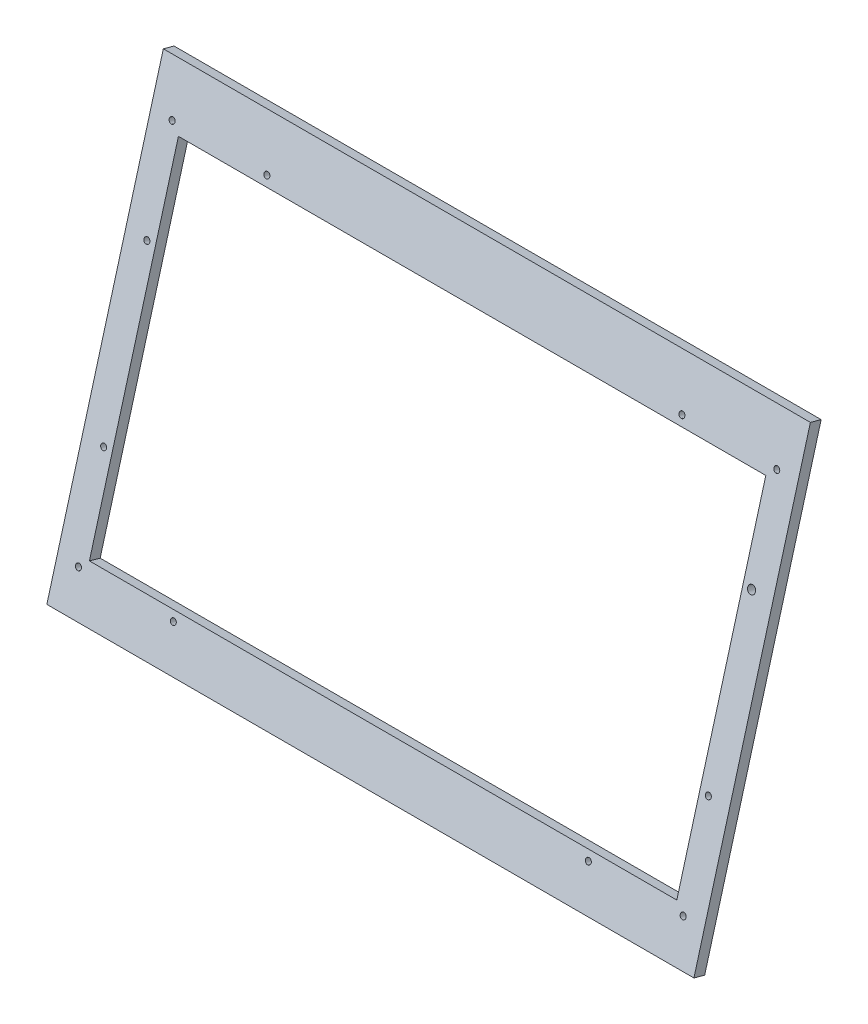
ISO-10303-21;
HEADER;
FILE_DESCRIPTION(('STEP AP214'),'2;1');
FILE_NAME('part.step','',(''),(''),'','','');
FILE_SCHEMA(('AUTOMOTIVE_DESIGN { 1 0 10303 214 1 1 1 1 }'));
ENDSEC;
DATA;
#1=APPLICATION_CONTEXT('core data for automotive mechanical design processes');
#2=APPLICATION_PROTOCOL_DEFINITION('international standard','automotive_design',2000,#1);
#3=PRODUCT_CONTEXT('',#1,'mechanical');
#4=PRODUCT('Part','Part','',(#3));
#5=PRODUCT_RELATED_PRODUCT_CATEGORY('part','',(#4));
#6=PRODUCT_DEFINITION_FORMATION('','',#4);
#7=PRODUCT_DEFINITION_CONTEXT('part definition',#1,'design');
#8=PRODUCT_DEFINITION('design','',#6,#7);
#9=PRODUCT_DEFINITION_SHAPE('','',#8);
#10=(LENGTH_UNIT() NAMED_UNIT(*) SI_UNIT(.MILLI.,.METRE.));
#11=(NAMED_UNIT(*) PLANE_ANGLE_UNIT() SI_UNIT($,.RADIAN.));
#12=(NAMED_UNIT(*) SI_UNIT($,.STERADIAN.) SOLID_ANGLE_UNIT());
#13=UNCERTAINTY_MEASURE_WITH_UNIT(LENGTH_MEASURE(1.E-05),#10,'distance_accuracy_value','');
#14=(GEOMETRIC_REPRESENTATION_CONTEXT(3) GLOBAL_UNCERTAINTY_ASSIGNED_CONTEXT((#13)) GLOBAL_UNIT_ASSIGNED_CONTEXT((#10,
#11,#12)) REPRESENTATION_CONTEXT('',''));
#15=CARTESIAN_POINT('',(0.,0.,0.));
#16=DIRECTION('',(0.,0.,1.));
#17=DIRECTION('',(1.,0.,0.));
#18=AXIS2_PLACEMENT_3D('',#15,#16,#17);
#19=CARTESIAN_POINT('',(600.,-3.42177176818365,-2.4853294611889));
#20=DIRECTION('',(0.,-0.964109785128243,0.265503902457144));
#21=DIRECTION('',(0.,-0.265503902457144,-0.964109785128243));
#22=AXIS2_PLACEMENT_3D('',#19,#20,#21);
#23=PLANE('',#22);
#24=DIRECTION('',(-1.,0.,0.));
#25=VECTOR('',#24,1.);
#26=CARTESIAN_POINT('',(600.,-6.07681079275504,-12.1264273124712));
#27=LINE('',#26,#25);
#28=CARTESIAN_POINT('',(590.,-6.07681079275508,-12.1264273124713));
#29=VERTEX_POINT('',#28);
#30=CARTESIAN_POINT('',(10.,-6.07681079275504,-12.1264273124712));
#31=VERTEX_POINT('',#30);
#32=EDGE_CURVE('E115',#29,#31,#27,.T.);
#33=ORIENTED_EDGE('',*,*,#32,.T.);
#34=DIRECTION('',(0.,0.265503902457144,0.964109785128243));
#35=VECTOR('',#34,1.);
#36=CARTESIAN_POINT('',(10.,-6.07681079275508,-12.1264273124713));
#37=LINE('',#36,#35);
#38=CARTESIAN_POINT('',(10.,-3.42177176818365,-2.4853294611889));
#39=VERTEX_POINT('',#38);
#40=EDGE_CURVE('E55',#31,#39,#37,.T.);
#41=ORIENTED_EDGE('',*,*,#40,.T.);
#42=DIRECTION('',(-1.,0.,0.));
#43=VECTOR('',#42,1.);
#44=CARTESIAN_POINT('',(600.,-3.42177176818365,-2.4853294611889));
#45=LINE('',#44,#43);
#46=CARTESIAN_POINT('',(590.,-3.42177176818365,-2.4853294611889));
#47=VERTEX_POINT('',#46);
#48=EDGE_CURVE('E117',#47,#39,#45,.T.);
#49=ORIENTED_EDGE('',*,*,#48,.F.);
#50=DIRECTION('',(0.,0.265503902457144,0.964109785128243));
#51=VECTOR('',#50,1.);
#52=CARTESIAN_POINT('',(590.,-6.07681079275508,-12.1264273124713));
#53=LINE('',#52,#51);
#54=EDGE_CURVE('E164',#29,#47,#53,.T.);
#55=ORIENTED_EDGE('',*,*,#54,.F.);
#56=EDGE_LOOP('',(#33,#41,#49,#55));
#57=FACE_BOUND('',#56,.T.);
#58=ADVANCED_FACE('F33',(#57),#23,.F.);
#59=CARTESIAN_POINT('',(600.,-382.51938037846,101.913460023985));
#60=DIRECTION('',(0.,-0.265503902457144,-0.964109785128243));
#61=DIRECTION('',(0.,0.964109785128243,-0.265503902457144));
#62=AXIS2_PLACEMENT_3D('',#59,#60,#61);
#63=PLANE('',#62);
#64=CARTESIAN_POINT('',(114.,-348.573074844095,92.5650676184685));
#65=DIRECTION('',(0.,-0.265503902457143,-0.964109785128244));
#66=DIRECTION('',(0.,0.964109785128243,-0.265503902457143));
#67=AXIS2_PLACEMENT_3D('',#64,#65,#66);
#68=CIRCLE('',#67,2.59999999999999);
#69=CARTESIAN_POINT('',(114.,-346.066389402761,91.87475747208));
#70=VERTEX_POINT('',#69);
#71=EDGE_CURVE('E206',#70,#70,#68,.T.);
#72=ORIENTED_EDGE('',*,*,#71,.T.);
#73=EDGE_LOOP('',(#72));
#74=FACE_BOUND('',#73,.T.);
#75=CARTESIAN_POINT('',(486.,-348.573074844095,92.5650676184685));
#76=DIRECTION('',(0.,-0.265503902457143,-0.964109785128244));
#77=DIRECTION('',(0.,0.964109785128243,-0.265503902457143));
#78=AXIS2_PLACEMENT_3D('',#75,#76,#77);
#79=CIRCLE('',#78,2.60000000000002);
#80=CARTESIAN_POINT('',(486.,-346.066389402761,91.87475747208));
#81=VERTEX_POINT('',#80);
#82=EDGE_CURVE('E213',#81,#81,#79,.T.);
#83=ORIENTED_EDGE('',*,*,#82,.T.);
#84=EDGE_LOOP('',(#83));
#85=FACE_BOUND('',#84,.T.);
#86=CARTESIAN_POINT('',(571.,-266.623743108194,69.9972359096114));
#87=DIRECTION('',(0.,-0.265503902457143,-0.964109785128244));
#88=DIRECTION('',(0.,0.964109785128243,-0.265503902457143));
#89=AXIS2_PLACEMENT_3D('',#86,#87,#88);
#90=CIRCLE('',#89,2.59999999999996);
#91=CARTESIAN_POINT('',(571.,-264.117057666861,69.3069257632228));
#92=VERTEX_POINT('',#91);
#93=EDGE_CURVE('E219',#92,#92,#90,.T.);
#94=ORIENTED_EDGE('',*,*,#93,.T.);
#95=EDGE_LOOP('',(#94));
#96=FACE_BOUND('',#95,.T.);
#97=CARTESIAN_POINT('',(486.,-43.9143827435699,8.66583444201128));
#98=DIRECTION('',(0.,-0.265503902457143,-0.964109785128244));
#99=DIRECTION('',(0.,0.964109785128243,-0.265503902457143));
#100=AXIS2_PLACEMENT_3D('',#97,#98,#99);
#101=CIRCLE('',#100,2.60000000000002);
#102=CARTESIAN_POINT('',(486.,-41.4076973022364,7.9755242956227));
#103=VERTEX_POINT('',#102);
#104=EDGE_CURVE('E183',#103,#103,#101,.T.);
#105=ORIENTED_EDGE('',*,*,#104,.T.);
#106=EDGE_LOOP('',(#105));
#107=FACE_BOUND('',#106,.T.);
#108=CARTESIAN_POINT('',(571.,-125.863714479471,31.2336661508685));
#109=DIRECTION('',(0.,-0.265503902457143,-0.964109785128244));
#110=DIRECTION('',(0.,0.964109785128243,-0.265503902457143));
#111=AXIS2_PLACEMENT_3D('',#108,#109,#110);
#112=CIRCLE('',#111,3.52103826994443);
#113=CARTESIAN_POINT('',(571.,-122.469047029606,30.2988167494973));
#114=VERTEX_POINT('',#113);
#115=EDGE_CURVE('E182',#114,#114,#112,.T.);
#116=ORIENTED_EDGE('',*,*,#115,.T.);
#117=EDGE_LOOP('',(#116));
#118=FACE_BOUND('',#117,.T.);
#119=CARTESIAN_POINT('',(29.0000000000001,-43.9143827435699,8.66583444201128));
#120=DIRECTION('',(0.,-0.265503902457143,-0.964109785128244));
#121=DIRECTION('',(0.,0.964109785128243,-0.265503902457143));
#122=AXIS2_PLACEMENT_3D('',#119,#120,#121);
#123=CIRCLE('',#122,2.6);
#124=CARTESIAN_POINT('',(29.0000000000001,-41.4076973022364,7.97552429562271));
#125=VERTEX_POINT('',#124);
#126=EDGE_CURVE('E189',#125,#125,#123,.T.);
#127=ORIENTED_EDGE('',*,*,#126,.T.);
#128=EDGE_LOOP('',(#127));
#129=FACE_BOUND('',#128,.T.);
#130=CARTESIAN_POINT('',(29.0000000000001,-348.573074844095,92.5650676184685));
#131=DIRECTION('',(0.,-0.265503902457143,-0.964109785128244));
#132=DIRECTION('',(0.,0.964109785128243,-0.265503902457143));
#133=AXIS2_PLACEMENT_3D('',#130,#131,#132);
#134=CIRCLE('',#133,2.6);
#135=CARTESIAN_POINT('',(29.0000000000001,-346.066389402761,91.87475747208));
#136=VERTEX_POINT('',#135);
#137=EDGE_CURVE('E195',#136,#136,#134,.T.);
#138=ORIENTED_EDGE('',*,*,#137,.T.);
#139=EDGE_LOOP('',(#138));
#140=FACE_BOUND('',#139,.T.);
#141=CARTESIAN_POINT('',(571.,-348.573074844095,92.5650676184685));
#142=DIRECTION('',(0.,-0.265503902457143,-0.964109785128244));
#143=DIRECTION('',(0.,0.964109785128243,-0.265503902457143));
#144=AXIS2_PLACEMENT_3D('',#141,#142,#143);
#145=CIRCLE('',#144,2.59999999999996);
#146=CARTESIAN_POINT('',(571.,-346.066389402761,91.87475747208));
#147=VERTEX_POINT('',#146);
#148=EDGE_CURVE('E176',#147,#147,#145,.T.);
#149=ORIENTED_EDGE('',*,*,#148,.T.);
#150=EDGE_LOOP('',(#149));
#151=FACE_BOUND('',#150,.T.);
#152=CARTESIAN_POINT('',(29.0000000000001,-266.623743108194,69.9972359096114));
#153=DIRECTION('',(0.,-0.265503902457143,-0.964109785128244));
#154=DIRECTION('',(0.,0.964109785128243,-0.265503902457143));
#155=AXIS2_PLACEMENT_3D('',#152,#153,#154);
#156=CIRCLE('',#155,2.6);
#157=CARTESIAN_POINT('',(29.0000000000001,-264.117057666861,69.3069257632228));
#158=VERTEX_POINT('',#157);
#159=EDGE_CURVE('E207',#158,#158,#156,.T.);
#160=ORIENTED_EDGE('',*,*,#159,.T.);
#161=EDGE_LOOP('',(#160));
#162=FACE_BOUND('',#161,.T.);
#163=CARTESIAN_POINT('',(29.0000000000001,-125.863714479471,31.2336661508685));
#164=DIRECTION('',(0.,-0.265503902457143,-0.964109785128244));
#165=DIRECTION('',(0.,0.964109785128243,-0.265503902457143));
#166=AXIS2_PLACEMENT_3D('',#163,#164,#165);
#167=CIRCLE('',#166,2.59999999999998);
#168=CARTESIAN_POINT('',(29.0000000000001,-123.357029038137,30.5433560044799));
#169=VERTEX_POINT('',#168);
#170=EDGE_CURVE('E236',#169,#169,#167,.T.);
#171=ORIENTED_EDGE('',*,*,#170,.T.);
#172=EDGE_LOOP('',(#171));
#173=FACE_BOUND('',#172,.T.);
#174=CARTESIAN_POINT('',(114.,-43.9143827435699,8.66583444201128));
#175=DIRECTION('',(0.,-0.265503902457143,-0.964109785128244));
#176=DIRECTION('',(0.,0.964109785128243,-0.265503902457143));
#177=AXIS2_PLACEMENT_3D('',#174,#175,#176);
#178=CIRCLE('',#177,2.59999999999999);
#179=CARTESIAN_POINT('',(114.,-41.4076973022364,7.97552429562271));
#180=VERTEX_POINT('',#179);
#181=EDGE_CURVE('E230',#180,#180,#178,.T.);
#182=ORIENTED_EDGE('',*,*,#181,.T.);
#183=EDGE_LOOP('',(#182));
#184=FACE_BOUND('',#183,.T.);
#185=CARTESIAN_POINT('',(571.,-43.9143827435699,8.66583444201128));
#186=DIRECTION('',(0.,-0.265503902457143,-0.964109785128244));
#187=DIRECTION('',(0.,0.964109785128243,-0.265503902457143));
#188=AXIS2_PLACEMENT_3D('',#185,#186,#187);
#189=CIRCLE('',#188,2.59999999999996);
#190=CARTESIAN_POINT('',(571.,-41.4076973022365,7.97552429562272));
#191=VERTEX_POINT('',#190);
#192=EDGE_CURVE('E169',#191,#191,#189,.T.);
#193=ORIENTED_EDGE('',*,*,#192,.T.);
#194=EDGE_LOOP('',(#193));
#195=FACE_BOUND('',#194,.T.);
#196=DIRECTION('',(1.,0.,0.));
#197=VECTOR('',#196,1.);
#198=CARTESIAN_POINT('',(36.7500000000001,-341.101224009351,90.5074123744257));
#199=LINE('',#198,#197);
#200=CARTESIAN_POINT('',(36.7500000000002,-341.101224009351,90.5074123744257));
#201=VERTEX_POINT('',#200);
#202=CARTESIAN_POINT('',(563.25,-341.101224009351,90.5074123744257));
#203=VERTEX_POINT('',#202);
#204=EDGE_CURVE('E158',#201,#203,#199,.T.);
#205=ORIENTED_EDGE('',*,*,#204,.F.);
#206=DIRECTION('',(0.,-0.964109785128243,0.265503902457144));
#207=VECTOR('',#206,1.);
#208=CARTESIAN_POINT('',(36.7500000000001,-51.3862335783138,10.723489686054));
#209=LINE('',#208,#207);
#210=CARTESIAN_POINT('',(36.7500000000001,-51.3862335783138,10.723489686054));
#211=VERTEX_POINT('',#210);
#212=EDGE_CURVE('E162',#211,#201,#209,.T.);
#213=ORIENTED_EDGE('',*,*,#212,.F.);
#214=DIRECTION('',(-1.,0.,0.));
#215=VECTOR('',#214,1.);
#216=CARTESIAN_POINT('',(36.7500000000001,-51.3862335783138,10.723489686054));
#217=LINE('',#216,#215);
#218=CARTESIAN_POINT('',(563.25,-51.3862335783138,10.723489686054));
#219=VERTEX_POINT('',#218);
#220=EDGE_CURVE('E152',#219,#211,#217,.T.);
#221=ORIENTED_EDGE('',*,*,#220,.F.);
#222=DIRECTION('',(0.,0.964109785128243,-0.265503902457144));
#223=VECTOR('',#222,1.);
#224=CARTESIAN_POINT('',(563.25,-51.3862335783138,10.723489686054));
#225=LINE('',#224,#223);
#226=EDGE_CURVE('E143',#203,#219,#225,.T.);
#227=ORIENTED_EDGE('',*,*,#226,.F.);
#228=EDGE_LOOP('',(#205,#213,#221,#227));
#229=FACE_BOUND('',#228,.T.);
#230=ORIENTED_EDGE('',*,*,#48,.T.);
#231=DIRECTION('',(0.,0.964109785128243,-0.265503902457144));
#232=VECTOR('',#231,1.);
#233=CARTESIAN_POINT('',(10.,-3.42177176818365,-2.4853294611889));
#234=LINE('',#233,#232);
#235=CARTESIAN_POINT('',(10.,-382.51938037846,101.913460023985));
#236=VERTEX_POINT('',#235);
#237=EDGE_CURVE('E103',#236,#39,#234,.T.);
#238=ORIENTED_EDGE('',*,*,#237,.F.);
#239=DIRECTION('',(-1.,0.,0.));
#240=VECTOR('',#239,1.);
#241=CARTESIAN_POINT('',(600.,-382.51938037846,101.913460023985));
#242=LINE('',#241,#240);
#243=CARTESIAN_POINT('',(590.,-382.51938037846,101.913460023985));
#244=VERTEX_POINT('',#243);
#245=EDGE_CURVE('E111',#244,#236,#242,.T.);
#246=ORIENTED_EDGE('',*,*,#245,.F.);
#247=DIRECTION('',(0.,-0.964109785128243,0.265503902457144));
#248=VECTOR('',#247,1.);
#249=CARTESIAN_POINT('',(590.,-3.42177176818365,-2.4853294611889));
#250=LINE('',#249,#248);
#251=EDGE_CURVE('E167',#47,#244,#250,.T.);
#252=ORIENTED_EDGE('',*,*,#251,.F.);
#253=EDGE_LOOP('',(#230,#238,#246,#252));
#254=FACE_BOUND('',#253,.T.);
#255=ADVANCED_FACE('F245',(#74,#85,#96,#107,#118,#129,#140,#151,#162,#173,#184,#195,#229,#254),
#63,.F.);
#256=CARTESIAN_POINT('',(600.,-385.174419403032,92.2723621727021));
#257=DIRECTION('',(0.,0.964109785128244,-0.265503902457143));
#258=DIRECTION('',(0.,0.265503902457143,0.964109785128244));
#259=AXIS2_PLACEMENT_3D('',#256,#257,#258);
#260=PLANE('',#259);
#261=ORIENTED_EDGE('',*,*,#245,.T.);
#262=DIRECTION('',(0.,0.265503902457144,0.964109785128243));
#263=VECTOR('',#262,1.);
#264=CARTESIAN_POINT('',(10.,-385.174419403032,92.2723621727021));
#265=LINE('',#264,#263);
#266=CARTESIAN_POINT('',(10.,-385.174419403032,92.2723621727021));
#267=VERTEX_POINT('',#266);
#268=EDGE_CURVE('E97',#267,#236,#265,.T.);
#269=ORIENTED_EDGE('',*,*,#268,.F.);
#270=DIRECTION('',(-1.,0.,0.));
#271=VECTOR('',#270,1.);
#272=CARTESIAN_POINT('',(600.,-385.174419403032,92.2723621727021));
#273=LINE('',#272,#271);
#274=CARTESIAN_POINT('',(590.,-385.174419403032,92.2723621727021));
#275=VERTEX_POINT('',#274);
#276=EDGE_CURVE('E109',#275,#267,#273,.T.);
#277=ORIENTED_EDGE('',*,*,#276,.F.);
#278=DIRECTION('',(0.,0.265503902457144,0.964109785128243));
#279=VECTOR('',#278,1.);
#280=CARTESIAN_POINT('',(590.,-385.174419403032,92.2723621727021));
#281=LINE('',#280,#279);
#282=EDGE_CURVE('E47',#275,#244,#281,.T.);
#283=ORIENTED_EDGE('',*,*,#282,.T.);
#284=EDGE_LOOP('',(#261,#269,#277,#283));
#285=FACE_BOUND('',#284,.T.);
#286=ADVANCED_FACE('F108',(#285),#260,.F.);
#287=CARTESIAN_POINT('',(600.,-6.07681079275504,-12.1264273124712));
#288=DIRECTION('',(0.,0.265503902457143,0.964109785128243));
#289=DIRECTION('',(0.,-0.964109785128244,0.265503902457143));
#290=AXIS2_PLACEMENT_3D('',#287,#288,#289);
#291=PLANE('',#290);
#292=CARTESIAN_POINT('',(114.,-351.228113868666,82.9239697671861));
#293=DIRECTION('',(0.,-0.265503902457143,-0.964109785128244));
#294=DIRECTION('',(0.,0.964109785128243,-0.265503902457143));
#295=AXIS2_PLACEMENT_3D('',#292,#293,#294);
#296=CIRCLE('',#295,2.59999999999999);
#297=CARTESIAN_POINT('',(114.,-348.721428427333,82.2336596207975));
#298=VERTEX_POINT('',#297);
#299=EDGE_CURVE('E203',#298,#298,#296,.T.);
#300=ORIENTED_EDGE('',*,*,#299,.F.);
#301=EDGE_LOOP('',(#300));
#302=FACE_BOUND('',#301,.T.);
#303=CARTESIAN_POINT('',(486.,-351.228113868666,82.9239697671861));
#304=DIRECTION('',(0.,-0.265503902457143,-0.964109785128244));
#305=DIRECTION('',(0.,0.964109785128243,-0.265503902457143));
#306=AXIS2_PLACEMENT_3D('',#303,#304,#305);
#307=CIRCLE('',#306,2.60000000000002);
#308=CARTESIAN_POINT('',(486.,-348.721428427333,82.2336596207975));
#309=VERTEX_POINT('',#308);
#310=EDGE_CURVE('E210',#309,#309,#307,.T.);
#311=ORIENTED_EDGE('',*,*,#310,.F.);
#312=EDGE_LOOP('',(#311));
#313=FACE_BOUND('',#312,.T.);
#314=CARTESIAN_POINT('',(571.,-269.278782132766,60.3561380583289));
#315=DIRECTION('',(0.,-0.265503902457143,-0.964109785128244));
#316=DIRECTION('',(0.,0.964109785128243,-0.265503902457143));
#317=AXIS2_PLACEMENT_3D('',#314,#315,#316);
#318=CIRCLE('',#317,2.59999999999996);
#319=CARTESIAN_POINT('',(571.,-266.772096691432,59.6658279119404));
#320=VERTEX_POINT('',#319);
#321=EDGE_CURVE('E216',#320,#320,#318,.T.);
#322=ORIENTED_EDGE('',*,*,#321,.F.);
#323=EDGE_LOOP('',(#322));
#324=FACE_BOUND('',#323,.T.);
#325=CARTESIAN_POINT('',(486.,-46.5694217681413,-0.975263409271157));
#326=DIRECTION('',(0.,-0.265503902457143,-0.964109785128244));
#327=DIRECTION('',(0.,0.964109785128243,-0.265503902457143));
#328=AXIS2_PLACEMENT_3D('',#325,#326,#327);
#329=CIRCLE('',#328,2.60000000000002);
#330=CARTESIAN_POINT('',(486.,-44.0627363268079,-1.66557355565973));
#331=VERTEX_POINT('',#330);
#332=EDGE_CURVE('E222',#331,#331,#329,.T.);
#333=ORIENTED_EDGE('',*,*,#332,.F.);
#334=EDGE_LOOP('',(#333));
#335=FACE_BOUND('',#334,.T.);
#336=CARTESIAN_POINT('',(571.,-128.518753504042,21.592568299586));
#337=DIRECTION('',(0.,-0.265503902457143,-0.964109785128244));
#338=DIRECTION('',(0.,0.964109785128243,-0.265503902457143));
#339=AXIS2_PLACEMENT_3D('',#336,#337,#338);
#340=CIRCLE('',#339,3.52103826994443);
#341=CARTESIAN_POINT('',(571.,-125.124086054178,20.6577188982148));
#342=VERTEX_POINT('',#341);
#343=EDGE_CURVE('E179',#342,#342,#340,.T.);
#344=ORIENTED_EDGE('',*,*,#343,.F.);
#345=EDGE_LOOP('',(#344));
#346=FACE_BOUND('',#345,.T.);
#347=CARTESIAN_POINT('',(29.0000000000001,-46.5694217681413,-0.975263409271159));
#348=DIRECTION('',(0.,-0.265503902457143,-0.964109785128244));
#349=DIRECTION('',(0.,0.964109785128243,-0.265503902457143));
#350=AXIS2_PLACEMENT_3D('',#347,#348,#349);
#351=CIRCLE('',#350,2.6);
#352=CARTESIAN_POINT('',(29.0000000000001,-44.0627363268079,-1.66557355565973));
#353=VERTEX_POINT('',#352);
#354=EDGE_CURVE('E186',#353,#353,#351,.T.);
#355=ORIENTED_EDGE('',*,*,#354,.F.);
#356=EDGE_LOOP('',(#355));
#357=FACE_BOUND('',#356,.T.);
#358=CARTESIAN_POINT('',(29.0000000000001,-351.228113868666,82.9239697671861));
#359=DIRECTION('',(0.,-0.265503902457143,-0.964109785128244));
#360=DIRECTION('',(0.,0.964109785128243,-0.265503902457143));
#361=AXIS2_PLACEMENT_3D('',#358,#359,#360);
#362=CIRCLE('',#361,2.6);
#363=CARTESIAN_POINT('',(29.0000000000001,-348.721428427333,82.2336596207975));
#364=VERTEX_POINT('',#363);
#365=EDGE_CURVE('E192',#364,#364,#362,.T.);
#366=ORIENTED_EDGE('',*,*,#365,.F.);
#367=EDGE_LOOP('',(#366));
#368=FACE_BOUND('',#367,.T.);
#369=CARTESIAN_POINT('',(571.,-351.228113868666,82.9239697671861));
#370=DIRECTION('',(0.,-0.265503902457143,-0.964109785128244));
#371=DIRECTION('',(0.,0.964109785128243,-0.265503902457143));
#372=AXIS2_PLACEMENT_3D('',#369,#370,#371);
#373=CIRCLE('',#372,2.59999999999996);
#374=CARTESIAN_POINT('',(571.,-348.721428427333,82.2336596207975));
#375=VERTEX_POINT('',#374);
#376=EDGE_CURVE('E198',#375,#375,#373,.T.);
#377=ORIENTED_EDGE('',*,*,#376,.F.);
#378=EDGE_LOOP('',(#377));
#379=FACE_BOUND('',#378,.T.);
#380=CARTESIAN_POINT('',(29.0000000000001,-269.278782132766,60.3561380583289));
#381=DIRECTION('',(0.,-0.265503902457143,-0.964109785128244));
#382=DIRECTION('',(0.,0.964109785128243,-0.265503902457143));
#383=AXIS2_PLACEMENT_3D('',#380,#381,#382);
#384=CIRCLE('',#383,2.6);
#385=CARTESIAN_POINT('',(29.0000000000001,-266.772096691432,59.6658279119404));
#386=VERTEX_POINT('',#385);
#387=EDGE_CURVE('E239',#386,#386,#384,.T.);
#388=ORIENTED_EDGE('',*,*,#387,.F.);
#389=EDGE_LOOP('',(#388));
#390=FACE_BOUND('',#389,.T.);
#391=CARTESIAN_POINT('',(29.0000000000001,-128.518753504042,21.592568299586));
#392=DIRECTION('',(0.,-0.265503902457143,-0.964109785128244));
#393=DIRECTION('',(0.,0.964109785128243,-0.265503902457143));
#394=AXIS2_PLACEMENT_3D('',#391,#392,#393);
#395=CIRCLE('',#394,2.59999999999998);
#396=CARTESIAN_POINT('',(29.0000000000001,-126.012068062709,20.9022581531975));
#397=VERTEX_POINT('',#396);
#398=EDGE_CURVE('E233',#397,#397,#395,.T.);
#399=ORIENTED_EDGE('',*,*,#398,.F.);
#400=EDGE_LOOP('',(#399));
#401=FACE_BOUND('',#400,.T.);
#402=CARTESIAN_POINT('',(114.,-46.5694217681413,-0.975263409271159));
#403=DIRECTION('',(0.,-0.265503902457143,-0.964109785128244));
#404=DIRECTION('',(0.,0.964109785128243,-0.265503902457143));
#405=AXIS2_PLACEMENT_3D('',#402,#403,#404);
#406=CIRCLE('',#405,2.59999999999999);
#407=CARTESIAN_POINT('',(114.,-44.0627363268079,-1.66557355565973));
#408=VERTEX_POINT('',#407);
#409=EDGE_CURVE('E227',#408,#408,#406,.T.);
#410=ORIENTED_EDGE('',*,*,#409,.F.);
#411=EDGE_LOOP('',(#410));
#412=FACE_BOUND('',#411,.T.);
#413=CARTESIAN_POINT('',(571.,-46.5694217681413,-0.975263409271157));
#414=DIRECTION('',(0.,-0.265503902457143,-0.964109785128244));
#415=DIRECTION('',(0.,0.964109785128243,-0.265503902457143));
#416=AXIS2_PLACEMENT_3D('',#413,#414,#415);
#417=CIRCLE('',#416,2.59999999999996);
#418=CARTESIAN_POINT('',(571.,-44.0627363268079,-1.66557355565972));
#419=VERTEX_POINT('',#418);
#420=EDGE_CURVE('E173',#419,#419,#417,.T.);
#421=ORIENTED_EDGE('',*,*,#420,.F.);
#422=EDGE_LOOP('',(#421));
#423=FACE_BOUND('',#422,.T.);
#424=DIRECTION('',(-1.,0.,0.));
#425=VECTOR('',#424,1.);
#426=CARTESIAN_POINT('',(600.,-54.0412726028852,1.0823918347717));
#427=LINE('',#426,#425);
#428=CARTESIAN_POINT('',(563.25,-54.0412726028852,1.08239183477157));
#429=VERTEX_POINT('',#428);
#430=CARTESIAN_POINT('',(36.7500000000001,-54.0412726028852,1.08239183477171));
#431=VERTEX_POINT('',#430);
#432=EDGE_CURVE('E40',#429,#431,#427,.T.);
#433=ORIENTED_EDGE('',*,*,#432,.T.);
#434=DIRECTION('',(0.,-0.964109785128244,0.265503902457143));
#435=VECTOR('',#434,1.);
#436=CARTESIAN_POINT('',(36.7500000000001,-6.07681079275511,-12.1264273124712));
#437=LINE('',#436,#435);
#438=CARTESIAN_POINT('',(36.7500000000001,-343.756263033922,80.8663145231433));
#439=VERTEX_POINT('',#438);
#440=EDGE_CURVE('E11',#431,#439,#437,.T.);
#441=ORIENTED_EDGE('',*,*,#440,.T.);
#442=DIRECTION('',(1.,0.,0.));
#443=VECTOR('',#442,1.);
#444=CARTESIAN_POINT('',(600.,-343.756263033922,80.8663145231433));
#445=LINE('',#444,#443);
#446=CARTESIAN_POINT('',(563.25,-343.756263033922,80.8663145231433));
#447=VERTEX_POINT('',#446);
#448=EDGE_CURVE('E125',#439,#447,#445,.T.);
#449=ORIENTED_EDGE('',*,*,#448,.T.);
#450=DIRECTION('',(0.,0.964109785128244,-0.265503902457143));
#451=VECTOR('',#450,1.);
#452=CARTESIAN_POINT('',(563.25,-6.07681079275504,-12.1264273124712));
#453=LINE('',#452,#451);
#454=EDGE_CURVE('E128',#447,#429,#453,.T.);
#455=ORIENTED_EDGE('',*,*,#454,.T.);
#456=EDGE_LOOP('',(#433,#441,#449,#455));
#457=FACE_BOUND('',#456,.T.);
#458=ORIENTED_EDGE('',*,*,#276,.T.);
#459=DIRECTION('',(0.,0.964109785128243,-0.265503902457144));
#460=VECTOR('',#459,1.);
#461=CARTESIAN_POINT('',(10.,-6.07681079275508,-12.1264273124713));
#462=LINE('',#461,#460);
#463=EDGE_CURVE('E94',#267,#31,#462,.T.);
#464=ORIENTED_EDGE('',*,*,#463,.T.);
#465=ORIENTED_EDGE('',*,*,#32,.F.);
#466=DIRECTION('',(0.,-0.964109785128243,0.265503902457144));
#467=VECTOR('',#466,1.);
#468=CARTESIAN_POINT('',(590.,-6.07681079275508,-12.1264273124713));
#469=LINE('',#468,#467);
#470=EDGE_CURVE('E114',#29,#275,#469,.T.);
#471=ORIENTED_EDGE('',*,*,#470,.T.);
#472=EDGE_LOOP('',(#458,#464,#465,#471));
#473=FACE_BOUND('',#472,.T.);
#474=ADVANCED_FACE('F113',(#302,#313,#324,#335,#346,#357,#368,#379,#390,#401,#412,#423,#457,
#473),#291,.F.);
#475=CARTESIAN_POINT('',(36.7500000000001,-184.138184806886,-471.331402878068));
#476=DIRECTION('',(-1.,0.,0.));
#477=DIRECTION('',(0.,-1.,0.));
#478=AXIS2_PLACEMENT_3D('',#475,#476,#477);
#479=PLANE('',#478);
#480=DIRECTION('',(0.,0.265503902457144,0.964109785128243));
#481=VECTOR('',#480,1.);
#482=CARTESIAN_POINT('',(36.7500000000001,-184.138184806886,-471.331402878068));
#483=LINE('',#482,#481);
#484=EDGE_CURVE('E119',#431,#211,#483,.T.);
#485=ORIENTED_EDGE('',*,*,#484,.T.);
#486=ORIENTED_EDGE('',*,*,#212,.T.);
#487=DIRECTION('',(0.,0.265503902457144,0.964109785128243));
#488=VECTOR('',#487,1.);
#489=CARTESIAN_POINT('',(36.7500000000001,-473.853175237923,-391.547480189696));
#490=LINE('',#489,#488);
#491=EDGE_CURVE('E148',#439,#201,#490,.T.);
#492=ORIENTED_EDGE('',*,*,#491,.F.);
#493=ORIENTED_EDGE('',*,*,#440,.F.);
#494=EDGE_LOOP('',(#485,#486,#492,#493));
#495=FACE_BOUND('',#494,.T.);
#496=ADVANCED_FACE('F258',(#495),#479,.F.);
#497=CARTESIAN_POINT('',(36.7500000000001,-184.138184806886,-471.331402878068));
#498=DIRECTION('',(0.,0.964109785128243,-0.265503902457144));
#499=DIRECTION('',(0.,0.265503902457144,0.964109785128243));
#500=AXIS2_PLACEMENT_3D('',#497,#498,#499);
#501=PLANE('',#500);
#502=DIRECTION('',(0.,0.265503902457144,0.964109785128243));
#503=VECTOR('',#502,1.);
#504=CARTESIAN_POINT('',(563.25,-184.138184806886,-471.331402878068));
#505=LINE('',#504,#503);
#506=EDGE_CURVE('E138',#429,#219,#505,.T.);
#507=ORIENTED_EDGE('',*,*,#506,.T.);
#508=ORIENTED_EDGE('',*,*,#220,.T.);
#509=ORIENTED_EDGE('',*,*,#484,.F.);
#510=ORIENTED_EDGE('',*,*,#432,.F.);
#511=EDGE_LOOP('',(#507,#508,#509,#510));
#512=FACE_BOUND('',#511,.T.);
#513=ADVANCED_FACE('F136',(#512),#501,.F.);
#514=CARTESIAN_POINT('',(563.25,-184.138184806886,-471.331402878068));
#515=DIRECTION('',(1.,0.,0.));
#516=DIRECTION('',(0.,0.,-1.));
#517=AXIS2_PLACEMENT_3D('',#514,#515,#516);
#518=PLANE('',#517);
#519=DIRECTION('',(0.,0.265503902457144,0.964109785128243));
#520=VECTOR('',#519,1.);
#521=CARTESIAN_POINT('',(563.25,-473.853175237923,-391.547480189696));
#522=LINE('',#521,#520);
#523=EDGE_CURVE('E145',#447,#203,#522,.T.);
#524=ORIENTED_EDGE('',*,*,#523,.T.);
#525=ORIENTED_EDGE('',*,*,#226,.T.);
#526=ORIENTED_EDGE('',*,*,#506,.F.);
#527=ORIENTED_EDGE('',*,*,#454,.F.);
#528=EDGE_LOOP('',(#524,#525,#526,#527));
#529=FACE_BOUND('',#528,.T.);
#530=ADVANCED_FACE('F141',(#529),#518,.F.);
#531=CARTESIAN_POINT('',(36.7500000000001,-473.853175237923,-391.547480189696));
#532=DIRECTION('',(0.,-0.964109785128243,0.265503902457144));
#533=DIRECTION('',(0.,-0.265503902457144,-0.964109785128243));
#534=AXIS2_PLACEMENT_3D('',#531,#532,#533);
#535=PLANE('',#534);
#536=ORIENTED_EDGE('',*,*,#491,.T.);
#537=ORIENTED_EDGE('',*,*,#204,.T.);
#538=ORIENTED_EDGE('',*,*,#523,.F.);
#539=ORIENTED_EDGE('',*,*,#448,.F.);
#540=EDGE_LOOP('',(#536,#537,#538,#539));
#541=FACE_BOUND('',#540,.T.);
#542=ADVANCED_FACE('F294',(#541),#535,.F.);
#543=CARTESIAN_POINT('',(590.,-6.07681079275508,-12.1264273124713));
#544=DIRECTION('',(-1.,0.,0.));
#545=DIRECTION('',(0.,0.,1.));
#546=AXIS2_PLACEMENT_3D('',#543,#544,#545);
#547=PLANE('',#546);
#548=ORIENTED_EDGE('',*,*,#251,.T.);
#549=ORIENTED_EDGE('',*,*,#282,.F.);
#550=ORIENTED_EDGE('',*,*,#470,.F.);
#551=ORIENTED_EDGE('',*,*,#54,.T.);
#552=EDGE_LOOP('',(#548,#549,#550,#551));
#553=FACE_BOUND('',#552,.T.);
#554=ADVANCED_FACE('F278',(#553),#547,.F.);
#555=CARTESIAN_POINT('',(10.,-6.07681079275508,-12.1264273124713));
#556=DIRECTION('',(1.,0.,0.));
#557=DIRECTION('',(0.,1.,0.));
#558=AXIS2_PLACEMENT_3D('',#555,#556,#557);
#559=PLANE('',#558);
#560=ORIENTED_EDGE('',*,*,#237,.T.);
#561=ORIENTED_EDGE('',*,*,#40,.F.);
#562=ORIENTED_EDGE('',*,*,#463,.F.);
#563=ORIENTED_EDGE('',*,*,#268,.T.);
#564=EDGE_LOOP('',(#560,#561,#562,#563));
#565=FACE_BOUND('',#564,.T.);
#566=ADVANCED_FACE('F96',(#565),#559,.F.);
#567=CARTESIAN_POINT('',(571.,-43.9143827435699,8.66583444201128));
#568=DIRECTION('',(0.,-0.265503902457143,-0.964109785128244));
#569=DIRECTION('',(0.,0.964109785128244,-0.265503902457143));
#570=AXIS2_PLACEMENT_3D('',#567,#568,#569);
#571=CYLINDRICAL_SURFACE('',#570,2.59999999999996);
#572=ORIENTED_EDGE('',*,*,#192,.F.);
#573=EDGE_LOOP('',(#572));
#574=FACE_BOUND('',#573,.T.);
#575=ORIENTED_EDGE('',*,*,#420,.T.);
#576=EDGE_LOOP('',(#575));
#577=FACE_BOUND('',#576,.T.);
#578=ADVANCED_FACE('F267',(#574,#577),#571,.F.);
#579=CARTESIAN_POINT('',(114.,-43.9143827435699,8.66583444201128));
#580=DIRECTION('',(0.,-0.265503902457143,-0.964109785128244));
#581=DIRECTION('',(0.,0.964109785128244,-0.265503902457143));
#582=AXIS2_PLACEMENT_3D('',#579,#580,#581);
#583=CYLINDRICAL_SURFACE('',#582,2.59999999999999);
#584=ORIENTED_EDGE('',*,*,#181,.F.);
#585=EDGE_LOOP('',(#584));
#586=FACE_BOUND('',#585,.T.);
#587=ORIENTED_EDGE('',*,*,#409,.T.);
#588=EDGE_LOOP('',(#587));
#589=FACE_BOUND('',#588,.T.);
#590=ADVANCED_FACE('F269',(#586,#589),#583,.F.);
#591=CARTESIAN_POINT('',(29.0000000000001,-125.863714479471,31.2336661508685));
#592=DIRECTION('',(0.,-0.265503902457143,-0.964109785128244));
#593=DIRECTION('',(0.,0.964109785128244,-0.265503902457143));
#594=AXIS2_PLACEMENT_3D('',#591,#592,#593);
#595=CYLINDRICAL_SURFACE('',#594,2.59999999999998);
#596=ORIENTED_EDGE('',*,*,#170,.F.);
#597=EDGE_LOOP('',(#596));
#598=FACE_BOUND('',#597,.T.);
#599=ORIENTED_EDGE('',*,*,#398,.T.);
#600=EDGE_LOOP('',(#599));
#601=FACE_BOUND('',#600,.T.);
#602=ADVANCED_FACE('F252',(#598,#601),#595,.F.);
#603=CARTESIAN_POINT('',(29.0000000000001,-266.623743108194,69.9972359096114));
#604=DIRECTION('',(0.,-0.265503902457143,-0.964109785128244));
#605=DIRECTION('',(0.,0.964109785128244,-0.265503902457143));
#606=AXIS2_PLACEMENT_3D('',#603,#604,#605);
#607=CYLINDRICAL_SURFACE('',#606,2.6);
#608=ORIENTED_EDGE('',*,*,#159,.F.);
#609=EDGE_LOOP('',(#608));
#610=FACE_BOUND('',#609,.T.);
#611=ORIENTED_EDGE('',*,*,#387,.T.);
#612=EDGE_LOOP('',(#611));
#613=FACE_BOUND('',#612,.T.);
#614=ADVANCED_FACE('F248',(#610,#613),#607,.F.);
#615=CARTESIAN_POINT('',(571.,-348.573074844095,92.5650676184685));
#616=DIRECTION('',(0.,-0.265503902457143,-0.964109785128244));
#617=DIRECTION('',(0.,0.964109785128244,-0.265503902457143));
#618=AXIS2_PLACEMENT_3D('',#615,#616,#617);
#619=CYLINDRICAL_SURFACE('',#618,2.59999999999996);
#620=ORIENTED_EDGE('',*,*,#148,.F.);
#621=EDGE_LOOP('',(#620));
#622=FACE_BOUND('',#621,.T.);
#623=ORIENTED_EDGE('',*,*,#376,.T.);
#624=EDGE_LOOP('',(#623));
#625=FACE_BOUND('',#624,.T.);
#626=ADVANCED_FACE('F251',(#622,#625),#619,.F.);
#627=CARTESIAN_POINT('',(29.0000000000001,-348.573074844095,92.5650676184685));
#628=DIRECTION('',(0.,-0.265503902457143,-0.964109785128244));
#629=DIRECTION('',(0.,0.964109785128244,-0.265503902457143));
#630=AXIS2_PLACEMENT_3D('',#627,#628,#629);
#631=CYLINDRICAL_SURFACE('',#630,2.6);
#632=ORIENTED_EDGE('',*,*,#137,.F.);
#633=EDGE_LOOP('',(#632));
#634=FACE_BOUND('',#633,.T.);
#635=ORIENTED_EDGE('',*,*,#365,.T.);
#636=EDGE_LOOP('',(#635));
#637=FACE_BOUND('',#636,.T.);
#638=ADVANCED_FACE('F386',(#634,#637),#631,.F.);
#639=CARTESIAN_POINT('',(29.0000000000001,-43.9143827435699,8.66583444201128));
#640=DIRECTION('',(0.,-0.265503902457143,-0.964109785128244));
#641=DIRECTION('',(0.,0.964109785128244,-0.265503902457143));
#642=AXIS2_PLACEMENT_3D('',#639,#640,#641);
#643=CYLINDRICAL_SURFACE('',#642,2.6);
#644=ORIENTED_EDGE('',*,*,#126,.F.);
#645=EDGE_LOOP('',(#644));
#646=FACE_BOUND('',#645,.T.);
#647=ORIENTED_EDGE('',*,*,#354,.T.);
#648=EDGE_LOOP('',(#647));
#649=FACE_BOUND('',#648,.T.);
#650=ADVANCED_FACE('F395',(#646,#649),#643,.F.);
#651=CARTESIAN_POINT('',(571.,-125.863714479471,31.2336661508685));
#652=DIRECTION('',(0.,-0.265503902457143,-0.964109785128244));
#653=DIRECTION('',(0.,0.964109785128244,-0.265503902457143));
#654=AXIS2_PLACEMENT_3D('',#651,#652,#653);
#655=CYLINDRICAL_SURFACE('',#654,3.52103826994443);
#656=ORIENTED_EDGE('',*,*,#115,.F.);
#657=EDGE_LOOP('',(#656));
#658=FACE_BOUND('',#657,.T.);
#659=ORIENTED_EDGE('',*,*,#343,.T.);
#660=EDGE_LOOP('',(#659));
#661=FACE_BOUND('',#660,.T.);
#662=ADVANCED_FACE('F404',(#658,#661),#655,.F.);
#663=CARTESIAN_POINT('',(486.,-43.9143827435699,8.66583444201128));
#664=DIRECTION('',(0.,-0.265503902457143,-0.964109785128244));
#665=DIRECTION('',(0.,0.964109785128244,-0.265503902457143));
#666=AXIS2_PLACEMENT_3D('',#663,#664,#665);
#667=CYLINDRICAL_SURFACE('',#666,2.60000000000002);
#668=ORIENTED_EDGE('',*,*,#104,.F.);
#669=EDGE_LOOP('',(#668));
#670=FACE_BOUND('',#669,.T.);
#671=ORIENTED_EDGE('',*,*,#332,.T.);
#672=EDGE_LOOP('',(#671));
#673=FACE_BOUND('',#672,.T.);
#674=ADVANCED_FACE('F413',(#670,#673),#667,.F.);
#675=CARTESIAN_POINT('',(571.,-266.623743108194,69.9972359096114));
#676=DIRECTION('',(0.,-0.265503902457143,-0.964109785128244));
#677=DIRECTION('',(0.,0.964109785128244,-0.265503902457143));
#678=AXIS2_PLACEMENT_3D('',#675,#676,#677);
#679=CYLINDRICAL_SURFACE('',#678,2.59999999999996);
#680=ORIENTED_EDGE('',*,*,#93,.F.);
#681=EDGE_LOOP('',(#680));
#682=FACE_BOUND('',#681,.T.);
#683=ORIENTED_EDGE('',*,*,#321,.T.);
#684=EDGE_LOOP('',(#683));
#685=FACE_BOUND('',#684,.T.);
#686=ADVANCED_FACE('F421',(#682,#685),#679,.F.);
#687=CARTESIAN_POINT('',(486.,-348.573074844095,92.5650676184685));
#688=DIRECTION('',(0.,-0.265503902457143,-0.964109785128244));
#689=DIRECTION('',(0.,0.964109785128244,-0.265503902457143));
#690=AXIS2_PLACEMENT_3D('',#687,#688,#689);
#691=CYLINDRICAL_SURFACE('',#690,2.60000000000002);
#692=ORIENTED_EDGE('',*,*,#82,.F.);
#693=EDGE_LOOP('',(#692));
#694=FACE_BOUND('',#693,.T.);
#695=ORIENTED_EDGE('',*,*,#310,.T.);
#696=EDGE_LOOP('',(#695));
#697=FACE_BOUND('',#696,.T.);
#698=ADVANCED_FACE('F430',(#694,#697),#691,.F.);
#699=CARTESIAN_POINT('',(114.,-348.573074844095,92.5650676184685));
#700=DIRECTION('',(0.,-0.265503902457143,-0.964109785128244));
#701=DIRECTION('',(0.,0.964109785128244,-0.265503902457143));
#702=AXIS2_PLACEMENT_3D('',#699,#700,#701);
#703=CYLINDRICAL_SURFACE('',#702,2.59999999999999);
#704=ORIENTED_EDGE('',*,*,#71,.F.);
#705=EDGE_LOOP('',(#704));
#706=FACE_BOUND('',#705,.T.);
#707=ORIENTED_EDGE('',*,*,#299,.T.);
#708=EDGE_LOOP('',(#707));
#709=FACE_BOUND('',#708,.T.);
#710=ADVANCED_FACE('F439',(#706,#709),#703,.F.);
#711=CLOSED_SHELL('',(#58,#255,#286,#474,#496,#513,#530,#542,#554,#566,#578,#590,#602,#614,#626,
#638,#650,#662,#674,#686,#698,#710));
#712=MANIFOLD_SOLID_BREP('B2',#711);
#713=ADVANCED_BREP_SHAPE_REPRESENTATION('',(#18,#712),#14);
#714=SHAPE_DEFINITION_REPRESENTATION(#9,#713);
ENDSEC;
END-ISO-10303-21;
